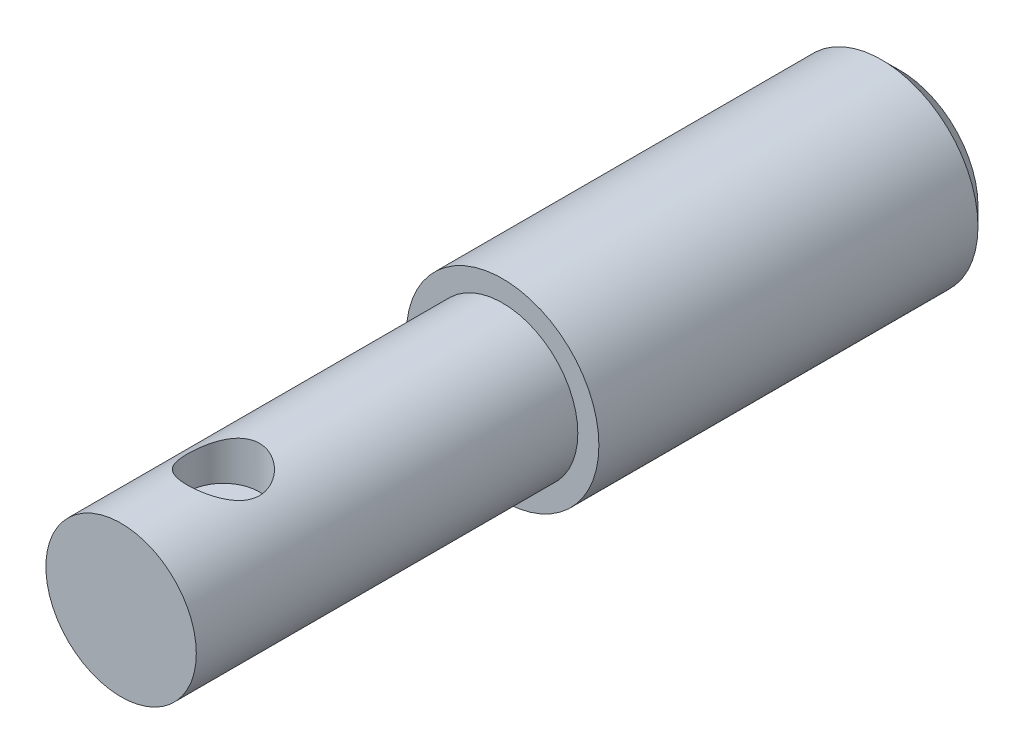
ISO-10303-21;
HEADER;
FILE_DESCRIPTION(('STEP AP214'),'2;1');
FILE_NAME('part.step','',(''),(''),'','','');
FILE_SCHEMA(('AUTOMOTIVE_DESIGN { 1 0 10303 214 1 1 1 1 }'));
ENDSEC;
DATA;
#1=APPLICATION_CONTEXT('core data for automotive mechanical design processes');
#2=APPLICATION_PROTOCOL_DEFINITION('international standard','automotive_design',2000,#1);
#3=PRODUCT_CONTEXT('',#1,'mechanical');
#4=PRODUCT('Part','Part','',(#3));
#5=PRODUCT_RELATED_PRODUCT_CATEGORY('part','',(#4));
#6=PRODUCT_DEFINITION_FORMATION('','',#4);
#7=PRODUCT_DEFINITION_CONTEXT('part definition',#1,'design');
#8=PRODUCT_DEFINITION('design','',#6,#7);
#9=PRODUCT_DEFINITION_SHAPE('','',#8);
#10=(LENGTH_UNIT() NAMED_UNIT(*) SI_UNIT(.MILLI.,.METRE.));
#11=(NAMED_UNIT(*) PLANE_ANGLE_UNIT() SI_UNIT($,.RADIAN.));
#12=(NAMED_UNIT(*) SI_UNIT($,.STERADIAN.) SOLID_ANGLE_UNIT());
#13=UNCERTAINTY_MEASURE_WITH_UNIT(LENGTH_MEASURE(1.E-05),#10,'distance_accuracy_value','');
#14=(GEOMETRIC_REPRESENTATION_CONTEXT(3) GLOBAL_UNCERTAINTY_ASSIGNED_CONTEXT((#13)) GLOBAL_UNIT_ASSIGNED_CONTEXT((#10,
#11,#12)) REPRESENTATION_CONTEXT('',''));
#15=CARTESIAN_POINT('',(0.,0.,0.));
#16=DIRECTION('',(0.,0.,1.));
#17=DIRECTION('',(1.,0.,0.));
#18=AXIS2_PLACEMENT_3D('',#15,#16,#17);
#19=CARTESIAN_POINT('',(0.,0.,16.5));
#20=DIRECTION('',(0.,0.,1.));
#21=DIRECTION('',(1.,0.,0.));
#22=AXIS2_PLACEMENT_3D('',#19,#20,#21);
#23=PLANE('',#22);
#24=CARTESIAN_POINT('',(0.,0.,16.5));
#25=DIRECTION('',(0.,0.,1.));
#26=DIRECTION('',(1.,0.,0.));
#27=AXIS2_PLACEMENT_3D('',#24,#25,#26);
#28=CIRCLE('',#27,4.);
#29=CARTESIAN_POINT('',(4.,0.,16.5));
#30=VERTEX_POINT('',#29);
#31=EDGE_CURVE('E51',#30,#30,#28,.T.);
#32=ORIENTED_EDGE('',*,*,#31,.T.);
#33=EDGE_LOOP('',(#32));
#34=FACE_BOUND('',#33,.T.);
#35=CARTESIAN_POINT('',(0.,0.,16.5));
#36=DIRECTION('',(0.,0.,1.));
#37=DIRECTION('',(1.,0.,0.));
#38=AXIS2_PLACEMENT_3D('',#35,#36,#37);
#39=CIRCLE('',#38,3.125);
#40=CARTESIAN_POINT('',(3.125,0.,16.5));
#41=VERTEX_POINT('',#40);
#42=EDGE_CURVE('E57',#41,#41,#39,.T.);
#43=ORIENTED_EDGE('',*,*,#42,.F.);
#44=EDGE_LOOP('',(#43));
#45=FACE_BOUND('',#44,.T.);
#46=ADVANCED_FACE('F32',(#34,#45),#23,.T.);
#47=CARTESIAN_POINT('',(0.,0.,16.5));
#48=DIRECTION('',(0.,0.,-1.));
#49=DIRECTION('',(-1.,0.,0.));
#50=AXIS2_PLACEMENT_3D('',#47,#48,#49);
#51=CYLINDRICAL_SURFACE('',#50,4.);
#52=CARTESIAN_POINT('',(0.,0.,0.750000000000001));
#53=DIRECTION('',(0.,0.,1.));
#54=DIRECTION('',(1.,0.,0.));
#55=AXIS2_PLACEMENT_3D('',#52,#53,#54);
#56=CIRCLE('',#55,4.);
#57=CARTESIAN_POINT('',(4.,0.,0.750000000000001));
#58=VERTEX_POINT('',#57);
#59=EDGE_CURVE('E47',#58,#58,#56,.T.);
#60=ORIENTED_EDGE('',*,*,#59,.T.);
#61=EDGE_LOOP('',(#60));
#62=FACE_BOUND('',#61,.T.);
#63=ORIENTED_EDGE('',*,*,#31,.F.);
#64=EDGE_LOOP('',(#63));
#65=FACE_BOUND('',#64,.T.);
#66=ADVANCED_FACE('F80',(#62,#65),#51,.T.);
#67=CARTESIAN_POINT('',(0.,0.,0.));
#68=DIRECTION('',(0.,0.,1.));
#69=DIRECTION('',(1.,0.,0.));
#70=AXIS2_PLACEMENT_3D('',#67,#68,#69);
#71=PLANE('',#70);
#72=CARTESIAN_POINT('',(0.,0.,0.));
#73=DIRECTION('',(0.,0.,1.));
#74=DIRECTION('',(1.,0.,0.));
#75=AXIS2_PLACEMENT_3D('',#72,#73,#74);
#76=CIRCLE('',#75,3.25);
#77=CARTESIAN_POINT('',(3.25,0.,0.));
#78=VERTEX_POINT('',#77);
#79=EDGE_CURVE('E43',#78,#78,#76,.F.);
#80=ORIENTED_EDGE('',*,*,#79,.T.);
#81=EDGE_LOOP('',(#80));
#82=FACE_BOUND('',#81,.T.);
#83=ADVANCED_FACE('F86',(#82),#71,.F.);
#84=CARTESIAN_POINT('',(0.,0.,32.35));
#85=DIRECTION('',(0.,0.,-1.));
#86=DIRECTION('',(-1.,0.,0.));
#87=AXIS2_PLACEMENT_3D('',#84,#85,#86);
#88=CYLINDRICAL_SURFACE('',#87,3.125);
#89=CARTESIAN_POINT('',(0.,3.12499999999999,29.6));
#90=CARTESIAN_POINT('',(-0.0792312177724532,3.12499605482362,29.5999953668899));
#91=CARTESIAN_POINT('',(-0.158567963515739,3.12195390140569,29.5936854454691));
#92=CARTESIAN_POINT('',(-0.314920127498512,3.11008502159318,29.5687137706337));
#93=CARTESIAN_POINT('',(-0.391930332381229,3.10124618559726,29.5500261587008));
#94=CARTESIAN_POINT('',(-0.541124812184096,3.0787140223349,29.5011855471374));
#95=CARTESIAN_POINT('',(-0.61332612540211,3.06503905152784,29.4710758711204));
#96=CARTESIAN_POINT('',(-0.751556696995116,3.03410801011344,29.4004583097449));
#97=CARTESIAN_POINT('',(-0.817586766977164,3.016852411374,29.3599517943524));
#98=CARTESIAN_POINT('',(-0.945840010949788,2.97921628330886,29.2670515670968));
#99=CARTESIAN_POINT('',(-1.00763116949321,2.9587136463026,29.2141115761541));
#100=CARTESIAN_POINT('',(-1.12185004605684,2.917323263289,29.0990163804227));
#101=CARTESIAN_POINT('',(-1.17427122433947,2.89643525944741,29.0368547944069));
#102=CARTESIAN_POINT('',(-1.27192900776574,2.8549660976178,28.8998479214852));
#103=CARTESIAN_POINT('',(-1.31640595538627,2.83450874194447,28.8244194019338));
#104=CARTESIAN_POINT('',(-1.39185510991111,2.798236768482,28.6660541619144));
#105=CARTESIAN_POINT('',(-1.42283636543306,2.78241904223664,28.5831225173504));
#106=CARTESIAN_POINT('',(-1.46849822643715,2.75858136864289,28.4170092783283));
#107=CARTESIAN_POINT('',(-1.48401475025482,2.7501648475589,28.3341170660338));
#108=CARTESIAN_POINT('',(-1.50088417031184,2.74099881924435,28.1665130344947));
#109=CARTESIAN_POINT('',(-1.5022491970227,2.74024274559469,28.0818028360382));
#110=CARTESIAN_POINT('',(-1.49139336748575,2.74615935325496,27.9227893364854));
#111=CARTESIAN_POINT('',(-1.48062448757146,2.75203820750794,27.8483505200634));
#112=CARTESIAN_POINT('',(-1.44830178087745,2.7691836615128,27.7025031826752));
#113=CARTESIAN_POINT('',(-1.42674494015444,2.78045176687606,27.6310955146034));
#114=CARTESIAN_POINT('',(-1.37304444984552,2.80736350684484,27.4913226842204));
#115=CARTESIAN_POINT('',(-1.34066618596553,2.82310283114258,27.4230669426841));
#116=CARTESIAN_POINT('',(-1.26641680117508,2.85718046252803,27.2926425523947));
#117=CARTESIAN_POINT('',(-1.22454146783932,2.87551992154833,27.2304766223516));
#118=CARTESIAN_POINT('',(-1.12683013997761,2.91529898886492,27.1064276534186));
#119=CARTESIAN_POINT('',(-1.0699396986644,2.93685184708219,27.0454087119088));
#120=CARTESIAN_POINT('',(-0.946607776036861,2.97889293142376,26.9334347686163));
#121=CARTESIAN_POINT('',(-0.880162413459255,2.9993807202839,26.8824838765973));
#122=CARTESIAN_POINT('',(-0.73624015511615,3.03798215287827,26.7902145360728));
#123=CARTESIAN_POINT('',(-0.658430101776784,3.05596930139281,26.749358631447));
#124=CARTESIAN_POINT('',(-0.495957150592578,3.08649682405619,26.6816361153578));
#125=CARTESIAN_POINT('',(-0.411299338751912,3.09904119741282,26.6547592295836));
#126=CARTESIAN_POINT('',(-0.244647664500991,3.11644587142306,26.6178218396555));
#127=CARTESIAN_POINT('',(-0.162964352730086,3.12183098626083,26.606609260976));
#128=CARTESIAN_POINT('',(0.00129048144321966,3.12607758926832,26.5977503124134));
#129=CARTESIAN_POINT('',(0.0838616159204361,3.12494181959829,26.6000982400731));
#130=CARTESIAN_POINT('',(0.241404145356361,3.11659109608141,26.6175814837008));
#131=CARTESIAN_POINT('',(0.316502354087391,3.10980814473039,26.6318082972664));
#132=CARTESIAN_POINT('',(0.463111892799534,3.09137735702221,26.6712620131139));
#133=CARTESIAN_POINT('',(0.534622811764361,3.07972896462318,26.6964901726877));
#134=CARTESIAN_POINT('',(0.674492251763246,3.05219939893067,26.7579596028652));
#135=CARTESIAN_POINT('',(0.742691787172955,3.03620170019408,26.7945086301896));
#136=CARTESIAN_POINT('',(0.872226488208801,3.00155773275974,26.8772431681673));
#137=CARTESIAN_POINT('',(0.933558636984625,2.98291030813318,26.9234328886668));
#138=CARTESIAN_POINT('',(1.05359224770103,2.94277634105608,27.0290616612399));
#139=CARTESIAN_POINT('',(1.11153186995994,2.92118646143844,27.0893289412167));
#140=CARTESIAN_POINT('',(1.21678760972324,2.87893667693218,27.2188654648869));
#141=CARTESIAN_POINT('',(1.26409778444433,2.85827729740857,27.2881397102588));
#142=CARTESIAN_POINT('',(1.34842009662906,2.81950869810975,27.4371534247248));
#143=CARTESIAN_POINT('',(1.38496619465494,2.80152811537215,27.5171929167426));
#144=CARTESIAN_POINT('',(1.44368289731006,2.77173343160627,27.6834350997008));
#145=CARTESIAN_POINT('',(1.46587049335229,2.75991204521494,27.7696303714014));
#146=CARTESIAN_POINT('',(1.49331843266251,2.74514953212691,27.9371467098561));
#147=CARTESIAN_POINT('',(1.49995930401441,2.741485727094,28.0181771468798));
#148=CARTESIAN_POINT('',(1.50004027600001,2.74144255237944,28.1802341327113));
#149=CARTESIAN_POINT('',(1.49348477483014,2.74506075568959,28.2612606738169));
#150=CARTESIAN_POINT('',(1.46862255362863,2.75843121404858,28.4140933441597));
#151=CARTESIAN_POINT('',(1.45131545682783,2.76766037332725,28.4861132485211));
#152=CARTESIAN_POINT('',(1.40660825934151,2.79064620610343,28.6261761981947));
#153=CARTESIAN_POINT('',(1.37920507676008,2.80440426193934,28.6942180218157));
#154=CARTESIAN_POINT('',(1.31300895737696,2.83602910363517,28.8294162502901));
#155=CARTESIAN_POINT('',(1.27357600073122,2.85410939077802,28.8962079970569));
#156=CARTESIAN_POINT('',(1.18519019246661,2.89193001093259,29.0226488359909));
#157=CARTESIAN_POINT('',(1.1362326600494,2.91167115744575,29.0822943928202));
#158=CARTESIAN_POINT('',(1.02393711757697,2.95315649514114,29.1994682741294));
#159=CARTESIAN_POINT('',(0.95961494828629,2.9748854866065,29.256063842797));
#160=CARTESIAN_POINT('',(0.821713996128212,3.01588801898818,29.3578266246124));
#161=CARTESIAN_POINT('',(0.748130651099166,3.03516034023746,29.4029881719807));
#162=CARTESIAN_POINT('',(0.59350513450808,3.06914252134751,29.4802959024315));
#163=CARTESIAN_POINT('',(0.512469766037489,3.08385649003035,29.5124538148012));
#164=CARTESIAN_POINT('',(0.345346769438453,3.1069957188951,29.5622898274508));
#165=CARTESIAN_POINT('',(0.259274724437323,3.11543937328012,29.5800102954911));
#166=CARTESIAN_POINT('',(0.143695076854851,3.12182739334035,29.5933803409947));
#167=CARTESIAN_POINT('',(0.115029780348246,3.12301447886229,29.5958597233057));
#168=CARTESIAN_POINT('',(0.0575809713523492,3.12460150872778,29.5991704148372));
#169=CARTESIAN_POINT('',(0.0287974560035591,3.12500143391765,29.6000016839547));
#170=CARTESIAN_POINT('',(0.,3.12499999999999,29.6));
#171=B_SPLINE_CURVE_WITH_KNOTS('',3,(#89,#90,#91,#92,#93,#94,#95,#96,#97,#98,#99,#100,#101,#102,
#103,#104,#105,#106,#107,#108,#109,#110,#111,#112,#113,#114,#115,#116,#117,#118,#119,#120,#121,
#122,#123,#124,#125,#126,#127,#128,#129,#130,#131,#132,#133,#134,#135,#136,#137,#138,#139,#140,
#141,#142,#143,#144,#145,#146,#147,#148,#149,#150,#151,#152,#153,#154,#155,#156,#157,#158,#159,
#160,#161,#162,#163,#164,#165,#166,#167,#168,#169,#170),.UNSPECIFIED.,.T.,.F.,(4,2,2,2,2,2,2,2,
2,2,2,2,2,2,2,2,2,2,2,2,2,2,2,2,2,2,2,2,2,2,2,2,2,2,2,2,2,2,2,2,4),(0.,0.237576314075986,
0.475650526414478,0.712830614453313,0.949979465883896,1.20065606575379,1.45150694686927,
1.71991520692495,1.9881432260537,2.24092575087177,2.49349157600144,2.71876846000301,
2.94410831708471,3.17469023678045,3.40537463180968,3.66273636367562,3.92020293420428,
4.18788777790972,4.45537559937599,4.70191634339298,4.9483534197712,5.17750457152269,
5.40668191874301,5.64273624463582,5.87889386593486,6.13678988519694,6.39482973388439,
6.66279374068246,6.9304400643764,7.17323303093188,7.41594509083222,7.63890725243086,
7.8619375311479,8.09990850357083,8.33799672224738,8.60193132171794,8.86599645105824,
9.12982285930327,9.39287223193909,9.47921985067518,9.56556957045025),.UNSPECIFIED.);
#172=CARTESIAN_POINT('',(0.,3.12499999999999,29.6));
#173=VERTEX_POINT('',#172);
#174=EDGE_CURVE('E10',#173,#173,#171,.T.);
#175=ORIENTED_EDGE('',*,*,#174,.T.);
#176=EDGE_LOOP('',(#175));
#177=FACE_BOUND('',#176,.T.);
#178=CARTESIAN_POINT('',(0.,0.,32.35));
#179=DIRECTION('',(0.,0.,1.));
#180=DIRECTION('',(1.,0.,0.));
#181=AXIS2_PLACEMENT_3D('',#178,#179,#180);
#182=CIRCLE('',#181,3.125);
#183=CARTESIAN_POINT('',(3.125,0.,32.35));
#184=VERTEX_POINT('',#183);
#185=EDGE_CURVE('E56',#184,#184,#182,.T.);
#186=ORIENTED_EDGE('',*,*,#185,.F.);
#187=EDGE_LOOP('',(#186));
#188=FACE_BOUND('',#187,.T.);
#189=ORIENTED_EDGE('',*,*,#42,.T.);
#190=EDGE_LOOP('',(#189));
#191=FACE_BOUND('',#190,.T.);
#192=ADVANCED_FACE('F90',(#177,#188,#191),#88,.T.);
#193=CARTESIAN_POINT('',(0.,0.,32.35));
#194=DIRECTION('',(0.,0.,1.));
#195=DIRECTION('',(1.,0.,0.));
#196=AXIS2_PLACEMENT_3D('',#193,#194,#195);
#197=PLANE('',#196);
#198=ORIENTED_EDGE('',*,*,#185,.T.);
#199=EDGE_LOOP('',(#198));
#200=FACE_BOUND('',#199,.T.);
#201=ADVANCED_FACE('F76',(#200),#197,.T.);
#202=CARTESIAN_POINT('',(0.,0.,0.750000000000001));
#203=DIRECTION('',(0.,0.,1.));
#204=DIRECTION('',(1.,0.,0.));
#205=AXIS2_PLACEMENT_3D('',#202,#203,#204);
#206=CONICAL_SURFACE('',#205,4.,0.785398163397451);
#207=ORIENTED_EDGE('',*,*,#79,.F.);
#208=EDGE_LOOP('',(#207));
#209=FACE_BOUND('',#208,.T.);
#210=ORIENTED_EDGE('',*,*,#59,.F.);
#211=EDGE_LOOP('',(#210));
#212=FACE_BOUND('',#211,.T.);
#213=ADVANCED_FACE('F34',(#209,#212),#206,.T.);
#214=CARTESIAN_POINT('',(0.,3.12499999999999,28.1));
#215=DIRECTION('',(0.,1.,0.));
#216=DIRECTION('',(0.,0.,1.));
#217=AXIS2_PLACEMENT_3D('',#214,#215,#216);
#218=CYLINDRICAL_SURFACE('',#217,1.5);
#219=CARTESIAN_POINT('',(0.,1.37500000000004,28.1));
#220=DIRECTION('',(0.,1.,0.));
#221=DIRECTION('',(0.,0.,1.));
#222=AXIS2_PLACEMENT_3D('',#219,#220,#221);
#223=CIRCLE('',#222,1.5);
#224=CARTESIAN_POINT('',(0.,1.37500000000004,29.6));
#225=VERTEX_POINT('',#224);
#226=EDGE_CURVE('E60',#225,#225,#223,.T.);
#227=ORIENTED_EDGE('',*,*,#226,.F.);
#228=EDGE_LOOP('',(#227));
#229=FACE_BOUND('',#228,.T.);
#230=ORIENTED_EDGE('',*,*,#174,.F.);
#231=EDGE_LOOP('',(#230));
#232=FACE_BOUND('',#231,.T.);
#233=ADVANCED_FACE('F68',(#229,#232),#218,.F.);
#234=CARTESIAN_POINT('',(0.,1.37500000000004,28.1));
#235=DIRECTION('',(0.,-1.,0.));
#236=DIRECTION('',(0.,0.,-1.));
#237=AXIS2_PLACEMENT_3D('',#234,#235,#236);
#238=PLANE('',#237);
#239=ORIENTED_EDGE('',*,*,#226,.T.);
#240=EDGE_LOOP('',(#239));
#241=FACE_BOUND('',#240,.T.);
#242=ADVANCED_FACE('F66',(#241),#238,.F.);
#243=CLOSED_SHELL('',(#46,#66,#83,#192,#201,#213,#233,#242));
#244=MANIFOLD_SOLID_BREP('B2',#243);
#245=ADVANCED_BREP_SHAPE_REPRESENTATION('',(#18,#244),#14);
#246=SHAPE_DEFINITION_REPRESENTATION(#9,#245);
ENDSEC;
END-ISO-10303-21;
